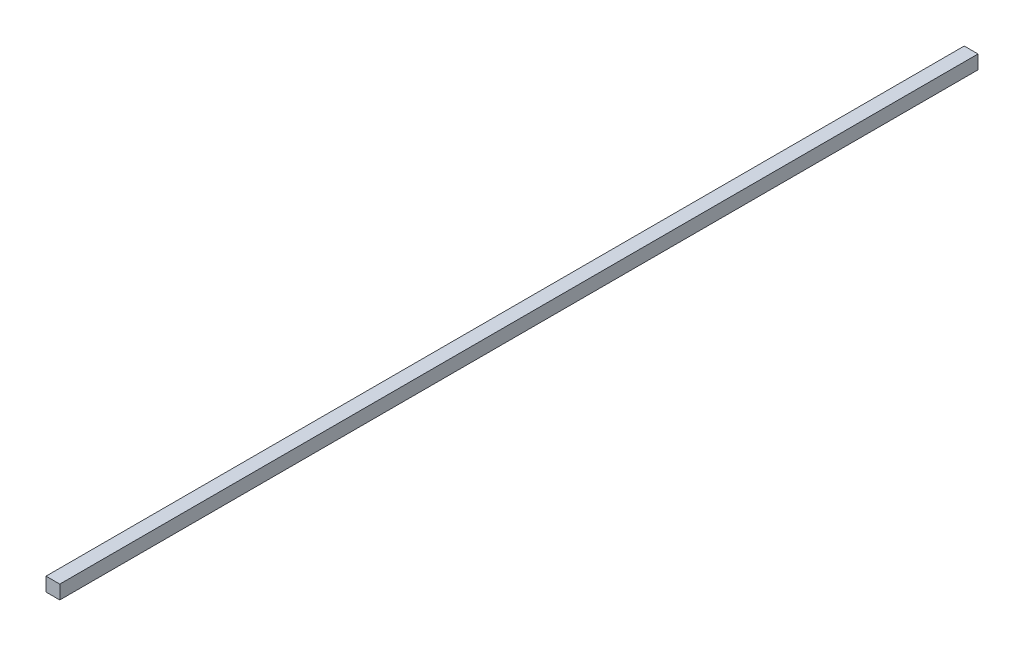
from build123d import *

# Parameters (mm, degrees)
ESQUISSE1_W      = 3
ESQUISSE1_H      = 3
EXTRUSION1_DEPTH = 200


with BuildPart() as part:
    # Esquisse1 → Extrusion1 (new body)
    with BuildSketch(Plane.XY):
        with Locations((1.5, 1.5)):
            Rectangle(ESQUISSE1_W, ESQUISSE1_H)
    extrude(amount=EXTRUSION1_DEPTH)


solid = part.part
